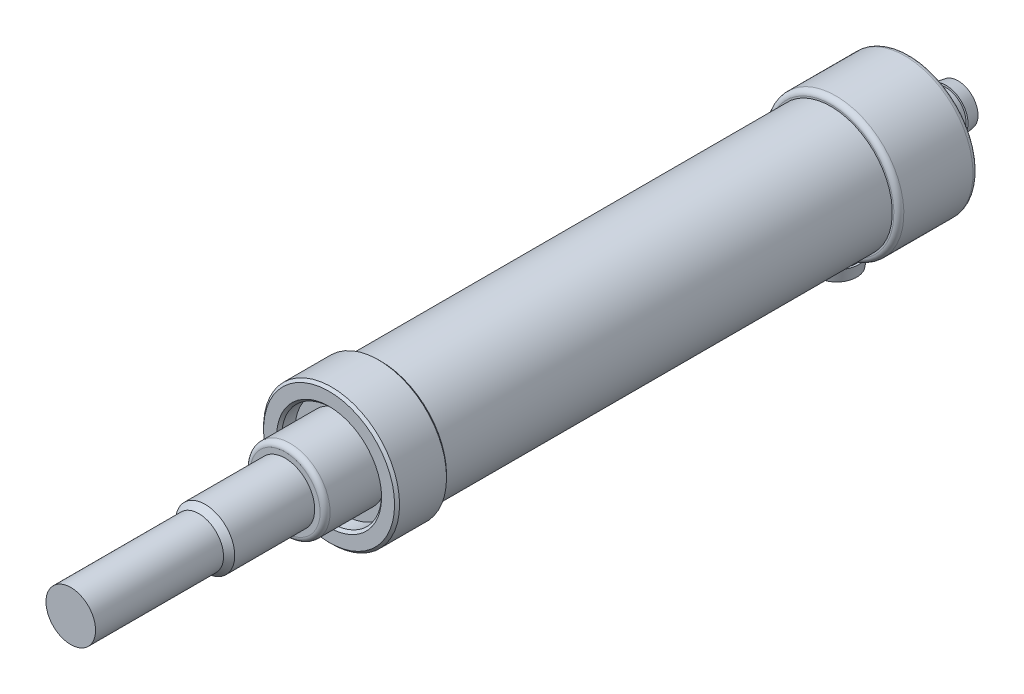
ISO-10303-21;
HEADER;
FILE_DESCRIPTION(('STEP AP214'),'2;1');
FILE_NAME('part.step','',(''),(''),'','','');
FILE_SCHEMA(('AUTOMOTIVE_DESIGN { 1 0 10303 214 1 1 1 1 }'));
ENDSEC;
DATA;
#1=APPLICATION_CONTEXT('core data for automotive mechanical design processes');
#2=APPLICATION_PROTOCOL_DEFINITION('international standard','automotive_design',2000,#1);
#3=PRODUCT_CONTEXT('',#1,'mechanical');
#4=PRODUCT('Part','Part','',(#3));
#5=PRODUCT_RELATED_PRODUCT_CATEGORY('part','',(#4));
#6=PRODUCT_DEFINITION_FORMATION('','',#4);
#7=PRODUCT_DEFINITION_CONTEXT('part definition',#1,'design');
#8=PRODUCT_DEFINITION('design','',#6,#7);
#9=PRODUCT_DEFINITION_SHAPE('','',#8);
#10=(LENGTH_UNIT() NAMED_UNIT(*) SI_UNIT(.MILLI.,.METRE.));
#11=(NAMED_UNIT(*) PLANE_ANGLE_UNIT() SI_UNIT($,.RADIAN.));
#12=(NAMED_UNIT(*) SI_UNIT($,.STERADIAN.) SOLID_ANGLE_UNIT());
#13=UNCERTAINTY_MEASURE_WITH_UNIT(LENGTH_MEASURE(1.E-05),#10,'distance_accuracy_value','');
#14=(GEOMETRIC_REPRESENTATION_CONTEXT(3) GLOBAL_UNCERTAINTY_ASSIGNED_CONTEXT((#13)) GLOBAL_UNIT_ASSIGNED_CONTEXT((#10,
#11,#12)) REPRESENTATION_CONTEXT('',''));
#15=CARTESIAN_POINT('',(0.,0.,0.));
#16=DIRECTION('',(0.,0.,1.));
#17=DIRECTION('',(1.,0.,0.));
#18=AXIS2_PLACEMENT_3D('',#15,#16,#17);
#19=CARTESIAN_POINT('',(0.,-21.59,-25.146));
#20=DIRECTION('',(0.,1.,0.));
#21=DIRECTION('',(0.,0.,1.));
#22=AXIS2_PLACEMENT_3D('',#19,#20,#21);
#23=PLANE('',#22);
#24=DIRECTION('',(0.,0.,1.));
#25=VECTOR('',#24,1.);
#26=CARTESIAN_POINT('',(-20.0025,-21.59,-25.146));
#27=LINE('',#26,#25);
#28=CARTESIAN_POINT('',(-20.0025,-21.59,-1.5875));
#29=VERTEX_POINT('',#28);
#30=CARTESIAN_POINT('',(-20.0025,-21.59,-23.5585));
#31=VERTEX_POINT('',#30);
#32=EDGE_CURVE('E137',#29,#31,#27,.F.);
#33=ORIENTED_EDGE('',*,*,#32,.T.);
#34=DIRECTION('',(-1.,0.,0.));
#35=VECTOR('',#34,1.);
#36=CARTESIAN_POINT('',(0.,-21.59,-23.5585));
#37=LINE('',#36,#35);
#38=CARTESIAN_POINT('',(0.,-21.59,-23.5585));
#39=VERTEX_POINT('',#38);
#40=EDGE_CURVE('E139',#31,#39,#37,.F.);
#41=ORIENTED_EDGE('',*,*,#40,.T.);
#42=DIRECTION('',(0.,0.,1.));
#43=VECTOR('',#42,1.);
#44=CARTESIAN_POINT('',(0.,-21.59,-25.146));
#45=LINE('',#44,#43);
#46=CARTESIAN_POINT('',(0.,-21.59,-1.5875));
#47=VERTEX_POINT('',#46);
#48=EDGE_CURVE('E261',#39,#47,#45,.T.);
#49=ORIENTED_EDGE('',*,*,#48,.T.);
#50=DIRECTION('',(-1.,0.,0.));
#51=VECTOR('',#50,1.);
#52=CARTESIAN_POINT('',(0.,-21.59,-1.5875));
#53=LINE('',#52,#51);
#54=EDGE_CURVE('E135',#47,#29,#53,.T.);
#55=ORIENTED_EDGE('',*,*,#54,.T.);
#56=EDGE_LOOP('',(#33,#41,#49,#55));
#57=FACE_BOUND('',#56,.T.);
#58=CARTESIAN_POINT('',(-11.557,-21.59,-13.3985));
#59=DIRECTION('',(0.,1.,0.));
#60=DIRECTION('',(0.,0.,1.));
#61=AXIS2_PLACEMENT_3D('',#58,#59,#60);
#62=CIRCLE('',#61,6.35);
#63=CARTESIAN_POINT('',(-11.557,-21.59,-7.0485));
#64=VERTEX_POINT('',#63);
#65=EDGE_CURVE('E42',#64,#64,#62,.F.);
#66=ORIENTED_EDGE('',*,*,#65,.F.);
#67=EDGE_LOOP('',(#66));
#68=FACE_BOUND('',#67,.T.);
#69=ADVANCED_FACE('F34',(#57,#68),#23,.F.);
#70=CARTESIAN_POINT('',(0.,0.,-25.146));
#71=DIRECTION('',(0.,0.,-1.));
#72=DIRECTION('',(-1.,0.,0.));
#73=AXIS2_PLACEMENT_3D('',#70,#71,#72);
#74=PLANE('',#73);
#75=DIRECTION('',(0.,1.,0.));
#76=VECTOR('',#75,1.);
#77=CARTESIAN_POINT('',(-20.0025,0.,-25.146));
#78=LINE('',#77,#76);
#79=CARTESIAN_POINT('',(-20.0025,-20.0025,-25.146));
#80=VERTEX_POINT('',#79);
#81=CARTESIAN_POINT('',(-20.0025,0.,-25.146));
#82=VERTEX_POINT('',#81);
#83=EDGE_CURVE('E116',#80,#82,#78,.T.);
#84=ORIENTED_EDGE('',*,*,#83,.T.);
#85=CARTESIAN_POINT('',(0.,0.,-25.146));
#86=DIRECTION('',(0.,0.,-1.));
#87=DIRECTION('',(-1.,0.,0.));
#88=AXIS2_PLACEMENT_3D('',#85,#86,#87);
#89=CIRCLE('',#88,20.0025);
#90=CARTESIAN_POINT('',(0.,-20.0025,-25.146));
#91=VERTEX_POINT('',#90);
#92=EDGE_CURVE('E101',#82,#91,#89,.T.);
#93=ORIENTED_EDGE('',*,*,#92,.T.);
#94=DIRECTION('',(-1.,0.,0.));
#95=VECTOR('',#94,1.);
#96=CARTESIAN_POINT('',(-21.59,-20.0025,-25.146));
#97=LINE('',#96,#95);
#98=EDGE_CURVE('E110',#91,#80,#97,.T.);
#99=ORIENTED_EDGE('',*,*,#98,.T.);
#100=EDGE_LOOP('',(#84,#93,#99));
#101=FACE_BOUND('',#100,.T.);
#102=CARTESIAN_POINT('',(0.,0.,-25.146));
#103=DIRECTION('',(0.,0.,-1.));
#104=DIRECTION('',(-1.,0.,0.));
#105=AXIS2_PLACEMENT_3D('',#102,#103,#104);
#106=CIRCLE('',#105,6.35);
#107=CARTESIAN_POINT('',(6.35,0.,-25.146));
#108=VERTEX_POINT('',#107);
#109=EDGE_CURVE('E289',#108,#108,#106,.T.);
#110=ORIENTED_EDGE('',*,*,#109,.F.);
#111=EDGE_LOOP('',(#110));
#112=FACE_BOUND('',#111,.T.);
#113=ADVANCED_FACE('F119',(#101,#112),#74,.T.);
#114=CARTESIAN_POINT('',(0.,0.,154.305));
#115=DIRECTION('',(0.,0.,1.));
#116=DIRECTION('',(1.,0.,0.));
#117=AXIS2_PLACEMENT_3D('',#114,#115,#116);
#118=PLANE('',#117);
#119=CARTESIAN_POINT('',(0.,0.,154.305));
#120=DIRECTION('',(0.,0.,1.));
#121=DIRECTION('',(1.,0.,0.));
#122=AXIS2_PLACEMENT_3D('',#119,#120,#121);
#123=CIRCLE('',#122,15.875);
#124=CARTESIAN_POINT('',(15.875,0.,154.305));
#125=VERTEX_POINT('',#124);
#126=EDGE_CURVE('E238',#125,#125,#123,.T.);
#127=ORIENTED_EDGE('',*,*,#126,.T.);
#128=EDGE_LOOP('',(#127));
#129=FACE_BOUND('',#128,.T.);
#130=CARTESIAN_POINT('',(0.,0.,154.305));
#131=DIRECTION('',(0.,0.,1.));
#132=DIRECTION('',(1.,0.,0.));
#133=AXIS2_PLACEMENT_3D('',#130,#131,#132);
#134=CIRCLE('',#133,12.7);
#135=CARTESIAN_POINT('',(-12.7,0.,154.305));
#136=VERTEX_POINT('',#135);
#137=EDGE_CURVE('E240',#136,#136,#134,.T.);
#138=ORIENTED_EDGE('',*,*,#137,.F.);
#139=EDGE_LOOP('',(#138));
#140=FACE_BOUND('',#139,.T.);
#141=ADVANCED_FACE('F156',(#129,#140),#118,.T.);
#142=CARTESIAN_POINT('',(0.,0.,142.875));
#143=DIRECTION('',(0.,0.,-1.));
#144=DIRECTION('',(-1.,0.,0.));
#145=AXIS2_PLACEMENT_3D('',#142,#143,#144);
#146=CYLINDRICAL_SURFACE('',#145,19.4945);
#147=CARTESIAN_POINT('',(0.,0.,142.875));
#148=DIRECTION('',(0.,0.,1.));
#149=DIRECTION('',(1.,0.,0.));
#150=AXIS2_PLACEMENT_3D('',#147,#148,#149);
#151=CIRCLE('',#150,19.4945);
#152=CARTESIAN_POINT('',(19.4945,0.,142.875));
#153=VERTEX_POINT('',#152);
#154=EDGE_CURVE('E239',#153,#153,#151,.T.);
#155=ORIENTED_EDGE('',*,*,#154,.F.);
#156=EDGE_LOOP('',(#155));
#157=FACE_BOUND('',#156,.T.);
#158=CARTESIAN_POINT('',(0.,0.,0.));
#159=DIRECTION('',(0.,0.,-1.));
#160=DIRECTION('',(-1.,0.,0.));
#161=AXIS2_PLACEMENT_3D('',#158,#159,#160);
#162=CIRCLE('',#161,19.4945);
#163=CARTESIAN_POINT('',(-19.4945,0.,0.));
#164=VERTEX_POINT('',#163);
#165=EDGE_CURVE('E246',#164,#164,#162,.T.);
#166=ORIENTED_EDGE('',*,*,#165,.F.);
#167=EDGE_LOOP('',(#166));
#168=FACE_BOUND('',#167,.T.);
#169=ADVANCED_FACE('F36',(#157,#168),#146,.T.);
#170=CARTESIAN_POINT('',(0.,0.,142.875));
#171=DIRECTION('',(0.,0.,1.));
#172=DIRECTION('',(1.,0.,0.));
#173=AXIS2_PLACEMENT_3D('',#170,#171,#172);
#174=PLANE('',#173);
#175=CARTESIAN_POINT('',(0.,0.,142.875));
#176=DIRECTION('',(0.,0.,1.));
#177=DIRECTION('',(1.,0.,0.));
#178=AXIS2_PLACEMENT_3D('',#175,#176,#177);
#179=CIRCLE('',#178,20.79625);
#180=CARTESIAN_POINT('',(20.79625,0.,142.875));
#181=VERTEX_POINT('',#180);
#182=EDGE_CURVE('E218',#181,#181,#179,.F.);
#183=ORIENTED_EDGE('',*,*,#182,.T.);
#184=EDGE_LOOP('',(#183));
#185=FACE_BOUND('',#184,.T.);
#186=ORIENTED_EDGE('',*,*,#154,.T.);
#187=EDGE_LOOP('',(#186));
#188=FACE_BOUND('',#187,.T.);
#189=ADVANCED_FACE('F198',(#185,#188),#174,.F.);
#190=CARTESIAN_POINT('',(0.,0.,159.385));
#191=DIRECTION('',(0.,0.,-1.));
#192=DIRECTION('',(-1.,0.,0.));
#193=AXIS2_PLACEMENT_3D('',#190,#191,#192);
#194=CYLINDRICAL_SURFACE('',#193,21.59);
#195=CARTESIAN_POINT('',(0.,0.,143.66875));
#196=DIRECTION('',(0.,0.,1.));
#197=DIRECTION('',(1.,0.,0.));
#198=AXIS2_PLACEMENT_3D('',#195,#196,#197);
#199=CIRCLE('',#198,21.59);
#200=CARTESIAN_POINT('',(21.59,0.,143.66875));
#201=VERTEX_POINT('',#200);
#202=EDGE_CURVE('E212',#201,#201,#199,.T.);
#203=ORIENTED_EDGE('',*,*,#202,.T.);
#204=EDGE_LOOP('',(#203));
#205=FACE_BOUND('',#204,.T.);
#206=CARTESIAN_POINT('',(0.,0.,158.59125));
#207=DIRECTION('',(0.,0.,1.));
#208=DIRECTION('',(1.,0.,0.));
#209=AXIS2_PLACEMENT_3D('',#206,#207,#208);
#210=CIRCLE('',#209,21.59);
#211=CARTESIAN_POINT('',(21.59,0.,158.59125));
#212=VERTEX_POINT('',#211);
#213=EDGE_CURVE('E215',#212,#212,#210,.F.);
#214=ORIENTED_EDGE('',*,*,#213,.T.);
#215=EDGE_LOOP('',(#214));
#216=FACE_BOUND('',#215,.T.);
#217=ADVANCED_FACE('F201',(#205,#216),#194,.T.);
#218=CARTESIAN_POINT('',(0.,0.,159.385));
#219=DIRECTION('',(0.,0.,1.));
#220=DIRECTION('',(1.,0.,0.));
#221=AXIS2_PLACEMENT_3D('',#218,#219,#220);
#222=PLANE('',#221);
#223=CARTESIAN_POINT('',(0.,0.,159.385));
#224=DIRECTION('',(0.,0.,1.));
#225=DIRECTION('',(1.,0.,0.));
#226=AXIS2_PLACEMENT_3D('',#223,#224,#225);
#227=CIRCLE('',#226,16.66875);
#228=CARTESIAN_POINT('',(16.66875,0.,159.385));
#229=VERTEX_POINT('',#228);
#230=EDGE_CURVE('E117',#229,#229,#227,.F.);
#231=ORIENTED_EDGE('',*,*,#230,.T.);
#232=EDGE_LOOP('',(#231));
#233=FACE_BOUND('',#232,.T.);
#234=CARTESIAN_POINT('',(0.,0.,159.385));
#235=DIRECTION('',(0.,0.,1.));
#236=DIRECTION('',(1.,0.,0.));
#237=AXIS2_PLACEMENT_3D('',#234,#235,#236);
#238=CIRCLE('',#237,20.79625);
#239=CARTESIAN_POINT('',(20.79625,0.,159.385));
#240=VERTEX_POINT('',#239);
#241=EDGE_CURVE('E216',#240,#240,#238,.T.);
#242=ORIENTED_EDGE('',*,*,#241,.T.);
#243=EDGE_LOOP('',(#242));
#244=FACE_BOUND('',#243,.T.);
#245=ADVANCED_FACE('F196',(#233,#244),#222,.T.);
#246=CARTESIAN_POINT('',(0.,0.,154.305));
#247=DIRECTION('',(0.,0.,1.));
#248=DIRECTION('',(1.,0.,0.));
#249=AXIS2_PLACEMENT_3D('',#246,#247,#248);
#250=CYLINDRICAL_SURFACE('',#249,15.875);
#251=CARTESIAN_POINT('',(0.,0.,158.59125));
#252=DIRECTION('',(0.,0.,1.));
#253=DIRECTION('',(1.,0.,0.));
#254=AXIS2_PLACEMENT_3D('',#251,#252,#253);
#255=CIRCLE('',#254,15.875);
#256=CARTESIAN_POINT('',(15.875,0.,158.59125));
#257=VERTEX_POINT('',#256);
#258=EDGE_CURVE('E227',#257,#257,#255,.T.);
#259=ORIENTED_EDGE('',*,*,#258,.T.);
#260=EDGE_LOOP('',(#259));
#261=FACE_BOUND('',#260,.T.);
#262=ORIENTED_EDGE('',*,*,#126,.F.);
#263=EDGE_LOOP('',(#262));
#264=FACE_BOUND('',#263,.T.);
#265=ADVANCED_FACE('F189',(#261,#264),#250,.F.);
#266=CARTESIAN_POINT('',(0.,0.,173.355));
#267=DIRECTION('',(0.,0.,-1.));
#268=DIRECTION('',(-1.,0.,0.));
#269=AXIS2_PLACEMENT_3D('',#266,#267,#268);
#270=CYLINDRICAL_SURFACE('',#269,12.7);
#271=CARTESIAN_POINT('',(0.,0.,171.7675));
#272=DIRECTION('',(0.,0.,1.));
#273=DIRECTION('',(1.,0.,0.));
#274=AXIS2_PLACEMENT_3D('',#271,#272,#273);
#275=CIRCLE('',#274,12.7);
#276=CARTESIAN_POINT('',(-12.7,0.,171.7675));
#277=VERTEX_POINT('',#276);
#278=EDGE_CURVE('E221',#277,#277,#275,.F.);
#279=CARTESIAN_POINT('',(-12.7,0.,171.7675));
#280=CARTESIAN_POINT('',(-12.7,0.,171.585598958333));
#281=CARTESIAN_POINT('',(-12.7,0.,171.403697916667));
#282=CARTESIAN_POINT('',(-12.7,0.,171.039895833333));
#283=CARTESIAN_POINT('',(-12.7,0.,170.857994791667));
#284=CARTESIAN_POINT('',(-12.7,0.,170.494192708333));
#285=CARTESIAN_POINT('',(-12.7,0.,170.312291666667));
#286=CARTESIAN_POINT('',(-12.7,0.,169.948489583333));
#287=CARTESIAN_POINT('',(-12.7,0.,169.766588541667));
#288=CARTESIAN_POINT('',(-12.7,0.,169.402786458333));
#289=CARTESIAN_POINT('',(-12.7,0.,169.220885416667));
#290=CARTESIAN_POINT('',(-12.7,0.,168.857083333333));
#291=CARTESIAN_POINT('',(-12.7,0.,168.675182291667));
#292=CARTESIAN_POINT('',(-12.7,0.,168.311380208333));
#293=CARTESIAN_POINT('',(-12.7,0.,168.129479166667));
#294=CARTESIAN_POINT('',(-12.7,0.,167.765677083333));
#295=CARTESIAN_POINT('',(-12.7,0.,167.583776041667));
#296=CARTESIAN_POINT('',(-12.7,0.,167.219973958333));
#297=CARTESIAN_POINT('',(-12.7,0.,167.038072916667));
#298=CARTESIAN_POINT('',(-12.7,0.,166.674270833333));
#299=CARTESIAN_POINT('',(-12.7,0.,166.492369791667));
#300=CARTESIAN_POINT('',(-12.7,0.,166.128567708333));
#301=CARTESIAN_POINT('',(-12.7,0.,165.946666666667));
#302=CARTESIAN_POINT('',(-12.7,0.,165.582864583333));
#303=CARTESIAN_POINT('',(-12.7,0.,165.400963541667));
#304=CARTESIAN_POINT('',(-12.7,0.,165.037161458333));
#305=CARTESIAN_POINT('',(-12.7,0.,164.855260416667));
#306=CARTESIAN_POINT('',(-12.7,0.,164.491458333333));
#307=CARTESIAN_POINT('',(-12.7,0.,164.309557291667));
#308=CARTESIAN_POINT('',(-12.7,0.,163.945755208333));
#309=CARTESIAN_POINT('',(-12.7,0.,163.763854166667));
#310=CARTESIAN_POINT('',(-12.7,0.,163.400052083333));
#311=CARTESIAN_POINT('',(-12.7,0.,163.218151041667));
#312=CARTESIAN_POINT('',(-12.7,0.,162.854348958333));
#313=CARTESIAN_POINT('',(-12.7,0.,162.672447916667));
#314=CARTESIAN_POINT('',(-12.7,0.,162.308645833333));
#315=CARTESIAN_POINT('',(-12.7,0.,162.126744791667));
#316=CARTESIAN_POINT('',(-12.7,0.,161.762942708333));
#317=CARTESIAN_POINT('',(-12.7,0.,161.581041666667));
#318=CARTESIAN_POINT('',(-12.7,0.,161.217239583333));
#319=CARTESIAN_POINT('',(-12.7,0.,161.035338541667));
#320=CARTESIAN_POINT('',(-12.7,0.,160.671536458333));
#321=CARTESIAN_POINT('',(-12.7,0.,160.489635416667));
#322=CARTESIAN_POINT('',(-12.7,0.,160.125833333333));
#323=CARTESIAN_POINT('',(-12.7,0.,159.943932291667));
#324=CARTESIAN_POINT('',(-12.7,0.,159.580130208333));
#325=CARTESIAN_POINT('',(-12.7,0.,159.398229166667));
#326=CARTESIAN_POINT('',(-12.7,0.,159.034427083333));
#327=CARTESIAN_POINT('',(-12.7,0.,158.852526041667));
#328=CARTESIAN_POINT('',(-12.7,0.,158.488723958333));
#329=CARTESIAN_POINT('',(-12.7,0.,158.306822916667));
#330=CARTESIAN_POINT('',(-12.7,0.,157.943020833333));
#331=CARTESIAN_POINT('',(-12.7,0.,157.761119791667));
#332=CARTESIAN_POINT('',(-12.7,0.,157.397317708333));
#333=CARTESIAN_POINT('',(-12.7,0.,157.215416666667));
#334=CARTESIAN_POINT('',(-12.7,0.,156.851614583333));
#335=CARTESIAN_POINT('',(-12.7,0.,156.669713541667));
#336=CARTESIAN_POINT('',(-12.7,0.,156.305911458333));
#337=CARTESIAN_POINT('',(-12.7,0.,156.124010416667));
#338=CARTESIAN_POINT('',(-12.7,0.,155.760208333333));
#339=CARTESIAN_POINT('',(-12.7,0.,155.578307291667));
#340=CARTESIAN_POINT('',(-12.7,0.,155.214505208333));
#341=CARTESIAN_POINT('',(-12.7,0.,155.032604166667));
#342=CARTESIAN_POINT('',(-12.7,0.,154.668802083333));
#343=CARTESIAN_POINT('',(-12.7,0.,154.486901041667));
#344=CARTESIAN_POINT('',(-12.7,0.,154.305));
#345=B_SPLINE_CURVE_WITH_KNOTS('',3,(#279,#280,#281,#282,#283,#284,#285,#286,#287,#288,#289,
#290,#291,#292,#293,#294,#295,#296,#297,#298,#299,#300,#301,#302,#303,#304,#305,#306,#307,#308,
#309,#310,#311,#312,#313,#314,#315,#316,#317,#318,#319,#320,#321,#322,#323,#324,#325,#326,#327,
#328,#329,#330,#331,#332,#333,#334,#335,#336,#337,#338,#339,#340,#341,#342,#343,#344),
.UNSPECIFIED.,.F.,.F.,(4,2,2,2,2,2,2,2,2,2,2,2,2,2,2,2,2,2,2,2,2,2,2,2,2,2,2,2,2,2,2,2,4),(0.,
0.545703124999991,1.09140624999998,1.637109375,2.18281249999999,2.72851562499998,3.27421875,
3.81992187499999,4.36562499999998,4.911328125,5.45703124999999,6.00273437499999,6.5484375,
7.094140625,7.63984374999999,8.18554687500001,8.73125,9.27695312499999,9.82265625,10.368359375,
10.9140625,11.459765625,12.00546875,12.551171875,13.096875,13.642578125,14.18828125,
14.733984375,15.2796875,15.825390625,16.37109375,16.916796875,17.4625),.UNSPECIFIED.);
#346=EDGE_CURVE('BSEAM185',#277,#136,#345,.T.);
#347=ORIENTED_EDGE('',*,*,#278,.T.);
#348=ORIENTED_EDGE('',*,*,#137,.T.);
#349=ORIENTED_EDGE('',*,*,#346,.T.);
#350=ORIENTED_EDGE('',*,*,#346,.F.);
#351=EDGE_LOOP('',(#347,#349,#348,#350));
#352=FACE_BOUND('',#351,.T.);
#353=ADVANCED_FACE('F185',(#352),#270,.T.);
#354=CARTESIAN_POINT('',(0.,0.,173.355));
#355=DIRECTION('',(0.,0.,1.));
#356=DIRECTION('',(1.,0.,0.));
#357=AXIS2_PLACEMENT_3D('',#354,#355,#356);
#358=PLANE('',#357);
#359=CARTESIAN_POINT('',(0.,0.,173.355));
#360=DIRECTION('',(0.,0.,1.));
#361=DIRECTION('',(1.,0.,0.));
#362=AXIS2_PLACEMENT_3D('',#359,#360,#361);
#363=CIRCLE('',#362,9.39799999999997);
#364=CARTESIAN_POINT('',(9.39799999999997,0.,173.355));
#365=VERTEX_POINT('',#364);
#366=EDGE_CURVE('E11',#365,#365,#363,.T.);
#367=ORIENTED_EDGE('',*,*,#366,.F.);
#368=EDGE_LOOP('',(#367));
#369=FACE_BOUND('',#368,.T.);
#370=CARTESIAN_POINT('',(0.,0.,173.355));
#371=DIRECTION('',(0.,0.,1.));
#372=DIRECTION('',(1.,0.,0.));
#373=AXIS2_PLACEMENT_3D('',#370,#371,#372);
#374=CIRCLE('',#373,11.1125);
#375=CARTESIAN_POINT('',(11.1125,0.,173.355));
#376=VERTEX_POINT('',#375);
#377=EDGE_CURVE('E243',#376,#376,#374,.T.);
#378=ORIENTED_EDGE('',*,*,#377,.T.);
#379=EDGE_LOOP('',(#378));
#380=FACE_BOUND('',#379,.T.);
#381=ADVANCED_FACE('F181',(#369,#380),#358,.T.);
#382=CARTESIAN_POINT('',(0.,0.,171.7675));
#383=DIRECTION('',(0.,0.,1.));
#384=DIRECTION('',(1.,0.,0.));
#385=AXIS2_PLACEMENT_3D('',#382,#383,#384);
#386=TOROIDAL_SURFACE('',#385,11.1125,1.5875);
#387=ORIENTED_EDGE('',*,*,#278,.F.);
#388=EDGE_LOOP('',(#387));
#389=FACE_BOUND('',#388,.T.);
#390=ORIENTED_EDGE('',*,*,#377,.F.);
#391=EDGE_LOOP('',(#390));
#392=FACE_BOUND('',#391,.T.);
#393=ADVANCED_FACE('F177',(#389,#392),#386,.T.);
#394=CARTESIAN_POINT('',(0.,0.,159.385));
#395=DIRECTION('',(0.,0.,-1.));
#396=DIRECTION('',(-1.,0.,0.));
#397=AXIS2_PLACEMENT_3D('',#394,#395,#396);
#398=CONICAL_SURFACE('',#397,20.79625,0.785398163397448);
#399=ORIENTED_EDGE('',*,*,#213,.F.);
#400=EDGE_LOOP('',(#399));
#401=FACE_BOUND('',#400,.T.);
#402=ORIENTED_EDGE('',*,*,#241,.F.);
#403=EDGE_LOOP('',(#402));
#404=FACE_BOUND('',#403,.T.);
#405=ADVANCED_FACE('F173',(#401,#404),#398,.T.);
#406=CARTESIAN_POINT('',(0.,0.,143.66875));
#407=DIRECTION('',(0.,0.,1.));
#408=DIRECTION('',(1.,0.,0.));
#409=AXIS2_PLACEMENT_3D('',#406,#407,#408);
#410=CONICAL_SURFACE('',#409,21.59,0.785398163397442);
#411=ORIENTED_EDGE('',*,*,#182,.F.);
#412=EDGE_LOOP('',(#411));
#413=FACE_BOUND('',#412,.T.);
#414=ORIENTED_EDGE('',*,*,#202,.F.);
#415=EDGE_LOOP('',(#414));
#416=FACE_BOUND('',#415,.T.);
#417=ADVANCED_FACE('F169',(#413,#416),#410,.T.);
#418=CARTESIAN_POINT('',(0.,0.,158.59125));
#419=DIRECTION('',(0.,0.,1.));
#420=DIRECTION('',(1.,0.,0.));
#421=AXIS2_PLACEMENT_3D('',#418,#419,#420);
#422=CONICAL_SURFACE('',#421,15.875,0.785398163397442);
#423=ORIENTED_EDGE('',*,*,#230,.F.);
#424=EDGE_LOOP('',(#423));
#425=FACE_BOUND('',#424,.T.);
#426=ORIENTED_EDGE('',*,*,#258,.F.);
#427=EDGE_LOOP('',(#426));
#428=FACE_BOUND('',#427,.T.);
#429=ADVANCED_FACE('F166',(#425,#428),#422,.F.);
#430=CARTESIAN_POINT('',(0.,0.,0.));
#431=DIRECTION('',(0.,0.,-1.));
#432=DIRECTION('',(-1.,0.,0.));
#433=AXIS2_PLACEMENT_3D('',#430,#431,#432);
#434=PLANE('',#433);
#435=CARTESIAN_POINT('',(0.,0.,0.));
#436=DIRECTION('',(0.,0.,-1.));
#437=DIRECTION('',(-1.,0.,0.));
#438=AXIS2_PLACEMENT_3D('',#435,#436,#437);
#439=CIRCLE('',#438,20.0025);
#440=CARTESIAN_POINT('',(0.,-20.0025,0.));
#441=VERTEX_POINT('',#440);
#442=CARTESIAN_POINT('',(-20.0025,0.,0.));
#443=VERTEX_POINT('',#442);
#444=EDGE_CURVE('E57',#441,#443,#439,.F.);
#445=ORIENTED_EDGE('',*,*,#444,.T.);
#446=DIRECTION('',(0.,1.,0.));
#447=VECTOR('',#446,1.);
#448=CARTESIAN_POINT('',(-20.0025,0.,0.));
#449=LINE('',#448,#447);
#450=CARTESIAN_POINT('',(-20.0025,-20.0025,0.));
#451=VERTEX_POINT('',#450);
#452=EDGE_CURVE('E144',#443,#451,#449,.F.);
#453=ORIENTED_EDGE('',*,*,#452,.T.);
#454=DIRECTION('',(-1.,0.,0.));
#455=VECTOR('',#454,1.);
#456=CARTESIAN_POINT('',(0.,-20.0025,0.));
#457=LINE('',#456,#455);
#458=EDGE_CURVE('E142',#451,#441,#457,.F.);
#459=ORIENTED_EDGE('',*,*,#458,.T.);
#460=EDGE_LOOP('',(#445,#453,#459));
#461=FACE_BOUND('',#460,.T.);
#462=ORIENTED_EDGE('',*,*,#165,.T.);
#463=EDGE_LOOP('',(#462));
#464=FACE_BOUND('',#463,.T.);
#465=ADVANCED_FACE('F164',(#461,#464),#434,.F.);
#466=CARTESIAN_POINT('',(0.,0.,-25.146));
#467=DIRECTION('',(0.,0.,1.));
#468=DIRECTION('',(1.,0.,0.));
#469=AXIS2_PLACEMENT_3D('',#466,#467,#468);
#470=CYLINDRICAL_SURFACE('',#469,21.59);
#471=ORIENTED_EDGE('',*,*,#48,.F.);
#472=CARTESIAN_POINT('',(0.,0.,-23.5585));
#473=DIRECTION('',(0.,0.,-1.));
#474=DIRECTION('',(-1.,0.,0.));
#475=AXIS2_PLACEMENT_3D('',#472,#473,#474);
#476=CIRCLE('',#475,21.59);
#477=CARTESIAN_POINT('',(-21.59,0.,-23.5585));
#478=VERTEX_POINT('',#477);
#479=EDGE_CURVE('E103',#39,#478,#476,.F.);
#480=ORIENTED_EDGE('',*,*,#479,.T.);
#481=DIRECTION('',(0.,0.,1.));
#482=VECTOR('',#481,1.);
#483=CARTESIAN_POINT('',(-21.59,0.,-25.146));
#484=LINE('',#483,#482);
#485=CARTESIAN_POINT('',(-21.59,0.,-1.5875));
#486=VERTEX_POINT('',#485);
#487=EDGE_CURVE('E264',#478,#486,#484,.T.);
#488=ORIENTED_EDGE('',*,*,#487,.T.);
#489=CARTESIAN_POINT('',(0.,0.,-1.5875));
#490=DIRECTION('',(0.,0.,-1.));
#491=DIRECTION('',(-1.,0.,0.));
#492=AXIS2_PLACEMENT_3D('',#489,#490,#491);
#493=CIRCLE('',#492,21.59);
#494=EDGE_CURVE('E123',#486,#47,#493,.T.);
#495=ORIENTED_EDGE('',*,*,#494,.T.);
#496=EDGE_LOOP('',(#471,#480,#488,#495));
#497=FACE_BOUND('',#496,.T.);
#498=ADVANCED_FACE('F161',(#497),#470,.T.);
#499=CARTESIAN_POINT('',(-21.59,0.,-25.146));
#500=DIRECTION('',(1.,0.,0.));
#501=DIRECTION('',(0.,0.,-1.));
#502=AXIS2_PLACEMENT_3D('',#499,#500,#501);
#503=PLANE('',#502);
#504=ORIENTED_EDGE('',*,*,#487,.F.);
#505=DIRECTION('',(0.,1.,0.));
#506=VECTOR('',#505,1.);
#507=CARTESIAN_POINT('',(-21.59,-21.59,-23.5585));
#508=LINE('',#507,#506);
#509=CARTESIAN_POINT('',(-21.59,-20.0025,-23.5585));
#510=VERTEX_POINT('',#509);
#511=EDGE_CURVE('E133',#478,#510,#508,.F.);
#512=ORIENTED_EDGE('',*,*,#511,.T.);
#513=DIRECTION('',(0.,0.,1.));
#514=VECTOR('',#513,1.);
#515=CARTESIAN_POINT('',(-21.59,-20.0025,-25.146));
#516=LINE('',#515,#514);
#517=CARTESIAN_POINT('',(-21.59,-20.0025,-1.5875));
#518=VERTEX_POINT('',#517);
#519=EDGE_CURVE('E131',#510,#518,#516,.T.);
#520=ORIENTED_EDGE('',*,*,#519,.T.);
#521=DIRECTION('',(0.,1.,0.));
#522=VECTOR('',#521,1.);
#523=CARTESIAN_POINT('',(-21.59,0.,-1.5875));
#524=LINE('',#523,#522);
#525=EDGE_CURVE('E129',#518,#486,#524,.T.);
#526=ORIENTED_EDGE('',*,*,#525,.T.);
#527=EDGE_LOOP('',(#504,#512,#520,#526));
#528=FACE_BOUND('',#527,.T.);
#529=ADVANCED_FACE('F160',(#528),#503,.F.);
#530=CARTESIAN_POINT('',(0.,0.,-1.5875));
#531=DIRECTION('',(0.,0.,-1.));
#532=DIRECTION('',(-1.,0.,0.));
#533=AXIS2_PLACEMENT_3D('',#530,#531,#532);
#534=TOROIDAL_SURFACE('',#533,20.0025,1.5875);
#535=CARTESIAN_POINT('',(0.,-20.0025,-1.5875));
#536=DIRECTION('',(-1.,0.,0.));
#537=DIRECTION('',(0.,0.,1.));
#538=AXIS2_PLACEMENT_3D('',#535,#536,#537);
#539=CIRCLE('',#538,1.5875);
#540=EDGE_CURVE('E270',#47,#441,#539,.T.);
#541=ORIENTED_EDGE('',*,*,#540,.F.);
#542=ORIENTED_EDGE('',*,*,#494,.F.);
#543=CARTESIAN_POINT('',(-20.0025,0.,-1.5875));
#544=DIRECTION('',(0.,-1.,0.));
#545=DIRECTION('',(0.,0.,-1.));
#546=AXIS2_PLACEMENT_3D('',#543,#544,#545);
#547=CIRCLE('',#546,1.5875);
#548=EDGE_CURVE('E267',#443,#486,#547,.T.);
#549=ORIENTED_EDGE('',*,*,#548,.F.);
#550=ORIENTED_EDGE('',*,*,#444,.F.);
#551=EDGE_LOOP('',(#541,#542,#549,#550));
#552=FACE_BOUND('',#551,.T.);
#553=ADVANCED_FACE('F478',(#552),#534,.T.);
#554=CARTESIAN_POINT('',(-20.0025,0.,-1.5875));
#555=DIRECTION('',(0.,1.,0.));
#556=DIRECTION('',(0.,0.,1.));
#557=AXIS2_PLACEMENT_3D('',#554,#555,#556);
#558=CYLINDRICAL_SURFACE('',#557,1.5875);
#559=ORIENTED_EDGE('',*,*,#548,.T.);
#560=ORIENTED_EDGE('',*,*,#525,.F.);
#561=CARTESIAN_POINT('',(-20.0025,-20.0025,-1.5875));
#562=DIRECTION('',(0.,-1.,0.));
#563=DIRECTION('',(0.,0.,-1.));
#564=AXIS2_PLACEMENT_3D('',#561,#562,#563);
#565=CIRCLE('',#564,1.5875);
#566=EDGE_CURVE('E273',#451,#518,#565,.T.);
#567=ORIENTED_EDGE('',*,*,#566,.F.);
#568=ORIENTED_EDGE('',*,*,#452,.F.);
#569=EDGE_LOOP('',(#559,#560,#567,#568));
#570=FACE_BOUND('',#569,.T.);
#571=ADVANCED_FACE('F474',(#570),#558,.T.);
#572=CARTESIAN_POINT('',(0.,-20.0025,-1.5875));
#573=DIRECTION('',(-1.,0.,0.));
#574=DIRECTION('',(0.,0.,1.));
#575=AXIS2_PLACEMENT_3D('',#572,#573,#574);
#576=CYLINDRICAL_SURFACE('',#575,1.5875);
#577=ORIENTED_EDGE('',*,*,#540,.T.);
#578=ORIENTED_EDGE('',*,*,#458,.F.);
#579=CARTESIAN_POINT('',(-20.0025,-20.0025,-1.5875));
#580=DIRECTION('',(-1.,0.,0.));
#581=DIRECTION('',(0.,0.,1.));
#582=AXIS2_PLACEMENT_3D('',#579,#580,#581);
#583=CIRCLE('',#582,1.5875);
#584=EDGE_CURVE('E49',#29,#451,#583,.T.);
#585=ORIENTED_EDGE('',*,*,#584,.F.);
#586=ORIENTED_EDGE('',*,*,#54,.F.);
#587=EDGE_LOOP('',(#577,#578,#585,#586));
#588=FACE_BOUND('',#587,.T.);
#589=ADVANCED_FACE('F471',(#588),#576,.T.);
#590=CARTESIAN_POINT('',(-20.0025,-20.0025,-1.5875));
#591=DIRECTION('',(0.,0.,1.));
#592=DIRECTION('',(1.,0.,0.));
#593=AXIS2_PLACEMENT_3D('',#590,#591,#592);
#594=SPHERICAL_SURFACE('',#593,1.5875);
#595=ORIENTED_EDGE('',*,*,#584,.T.);
#596=ORIENTED_EDGE('',*,*,#566,.T.);
#597=CARTESIAN_POINT('',(-20.0025,-20.0025,-1.5875));
#598=DIRECTION('',(0.,0.,1.));
#599=DIRECTION('',(1.,0.,0.));
#600=AXIS2_PLACEMENT_3D('',#597,#598,#599);
#601=CIRCLE('',#600,1.5875);
#602=EDGE_CURVE('E276',#29,#518,#601,.F.);
#603=ORIENTED_EDGE('',*,*,#602,.F.);
#604=EDGE_LOOP('',(#595,#596,#603));
#605=FACE_BOUND('',#604,.T.);
#606=ADVANCED_FACE('F467',(#605),#594,.T.);
#607=CARTESIAN_POINT('',(-20.0025,-20.0025,-25.146));
#608=DIRECTION('',(0.,0.,1.));
#609=DIRECTION('',(1.,0.,0.));
#610=AXIS2_PLACEMENT_3D('',#607,#608,#609);
#611=CYLINDRICAL_SURFACE('',#610,1.5875);
#612=CARTESIAN_POINT('',(-20.0025,-20.0025,-23.5585));
#613=DIRECTION('',(0.,0.,-1.));
#614=DIRECTION('',(-1.,0.,0.));
#615=AXIS2_PLACEMENT_3D('',#612,#613,#614);
#616=CIRCLE('',#615,1.5875);
#617=EDGE_CURVE('E279',#31,#510,#616,.T.);
#618=ORIENTED_EDGE('',*,*,#617,.F.);
#619=ORIENTED_EDGE('',*,*,#32,.F.);
#620=ORIENTED_EDGE('',*,*,#602,.T.);
#621=ORIENTED_EDGE('',*,*,#519,.F.);
#622=EDGE_LOOP('',(#618,#619,#620,#621));
#623=FACE_BOUND('',#622,.T.);
#624=ADVANCED_FACE('F463',(#623),#611,.T.);
#625=CARTESIAN_POINT('',(-20.0025,-20.0025,-23.5585));
#626=DIRECTION('',(0.,0.,1.));
#627=DIRECTION('',(1.,0.,0.));
#628=AXIS2_PLACEMENT_3D('',#625,#626,#627);
#629=SPHERICAL_SURFACE('',#628,1.5875);
#630=CARTESIAN_POINT('',(-20.0025,-20.0025,-23.5585));
#631=DIRECTION('',(-1.,0.,0.));
#632=DIRECTION('',(0.,0.,1.));
#633=AXIS2_PLACEMENT_3D('',#630,#631,#632);
#634=CIRCLE('',#633,1.5875);
#635=EDGE_CURVE('E113',#31,#80,#634,.F.);
#636=ORIENTED_EDGE('',*,*,#635,.F.);
#637=ORIENTED_EDGE('',*,*,#617,.T.);
#638=CARTESIAN_POINT('',(-20.0025,-20.0025,-23.5585));
#639=DIRECTION('',(0.,-1.,0.));
#640=DIRECTION('',(0.,0.,-1.));
#641=AXIS2_PLACEMENT_3D('',#638,#639,#640);
#642=CIRCLE('',#641,1.5875);
#643=EDGE_CURVE('E282',#80,#510,#642,.F.);
#644=ORIENTED_EDGE('',*,*,#643,.F.);
#645=EDGE_LOOP('',(#636,#637,#644));
#646=FACE_BOUND('',#645,.T.);
#647=ADVANCED_FACE('F459',(#646),#629,.T.);
#648=CARTESIAN_POINT('',(-20.0025,0.,-23.5585));
#649=DIRECTION('',(0.,-1.,0.));
#650=DIRECTION('',(0.,0.,-1.));
#651=AXIS2_PLACEMENT_3D('',#648,#649,#650);
#652=CYLINDRICAL_SURFACE('',#651,1.5875);
#653=ORIENTED_EDGE('',*,*,#643,.T.);
#654=ORIENTED_EDGE('',*,*,#511,.F.);
#655=CARTESIAN_POINT('',(-20.0025,0.,-23.5585));
#656=DIRECTION('',(0.,1.,0.));
#657=DIRECTION('',(0.,0.,1.));
#658=AXIS2_PLACEMENT_3D('',#655,#656,#657);
#659=CIRCLE('',#658,1.5875);
#660=EDGE_CURVE('E106',#82,#478,#659,.T.);
#661=ORIENTED_EDGE('',*,*,#660,.F.);
#662=ORIENTED_EDGE('',*,*,#83,.F.);
#663=EDGE_LOOP('',(#653,#654,#661,#662));
#664=FACE_BOUND('',#663,.T.);
#665=ADVANCED_FACE('F456',(#664),#652,.T.);
#666=CARTESIAN_POINT('',(0.,-20.0025,-23.5585));
#667=DIRECTION('',(1.,0.,0.));
#668=DIRECTION('',(0.,0.,-1.));
#669=AXIS2_PLACEMENT_3D('',#666,#667,#668);
#670=CYLINDRICAL_SURFACE('',#669,1.5875);
#671=ORIENTED_EDGE('',*,*,#635,.T.);
#672=ORIENTED_EDGE('',*,*,#98,.F.);
#673=CARTESIAN_POINT('',(0.,-20.0025,-23.5585));
#674=DIRECTION('',(1.,0.,0.));
#675=DIRECTION('',(0.,0.,-1.));
#676=AXIS2_PLACEMENT_3D('',#673,#674,#675);
#677=CIRCLE('',#676,1.5875);
#678=EDGE_CURVE('E97',#39,#91,#677,.T.);
#679=ORIENTED_EDGE('',*,*,#678,.F.);
#680=ORIENTED_EDGE('',*,*,#40,.F.);
#681=EDGE_LOOP('',(#671,#672,#679,#680));
#682=FACE_BOUND('',#681,.T.);
#683=ADVANCED_FACE('F111',(#682),#670,.T.);
#684=CARTESIAN_POINT('',(0.,0.,-23.5585));
#685=DIRECTION('',(0.,0.,-1.));
#686=DIRECTION('',(-1.,0.,0.));
#687=AXIS2_PLACEMENT_3D('',#684,#685,#686);
#688=TOROIDAL_SURFACE('',#687,20.0025,1.5875);
#689=ORIENTED_EDGE('',*,*,#660,.T.);
#690=ORIENTED_EDGE('',*,*,#479,.F.);
#691=ORIENTED_EDGE('',*,*,#678,.T.);
#692=ORIENTED_EDGE('',*,*,#92,.F.);
#693=EDGE_LOOP('',(#689,#690,#691,#692));
#694=FACE_BOUND('',#693,.T.);
#695=ADVANCED_FACE('F99',(#694),#688,.T.);
#696=CARTESIAN_POINT('',(0.,0.,-28.956));
#697=DIRECTION('',(0.,0.,1.));
#698=DIRECTION('',(1.,0.,0.));
#699=AXIS2_PLACEMENT_3D('',#696,#697,#698);
#700=CYLINDRICAL_SURFACE('',#699,6.35);
#701=CARTESIAN_POINT('',(0.,0.,-28.956));
#702=DIRECTION('',(0.,0.,-1.));
#703=DIRECTION('',(-1.,0.,0.));
#704=AXIS2_PLACEMENT_3D('',#701,#702,#703);
#705=CIRCLE('',#704,6.35);
#706=CARTESIAN_POINT('',(6.35,0.,-28.956));
#707=VERTEX_POINT('',#706);
#708=EDGE_CURVE('E107',#707,#707,#705,.T.);
#709=CARTESIAN_POINT('',(6.35,0.,-28.956));
#710=CARTESIAN_POINT('',(6.35,0.,-28.9163125));
#711=CARTESIAN_POINT('',(6.35,0.,-28.876625));
#712=CARTESIAN_POINT('',(6.35,0.,-28.79725));
#713=CARTESIAN_POINT('',(6.35,0.,-28.7575625));
#714=CARTESIAN_POINT('',(6.35,0.,-28.6781875));
#715=CARTESIAN_POINT('',(6.35,0.,-28.6385));
#716=CARTESIAN_POINT('',(6.35,0.,-28.559125));
#717=CARTESIAN_POINT('',(6.35,0.,-28.5194375));
#718=CARTESIAN_POINT('',(6.35,0.,-28.4400625));
#719=CARTESIAN_POINT('',(6.35,0.,-28.400375));
#720=CARTESIAN_POINT('',(6.35,0.,-28.321));
#721=CARTESIAN_POINT('',(6.35,0.,-28.2813125));
#722=CARTESIAN_POINT('',(6.35,0.,-28.2019375));
#723=CARTESIAN_POINT('',(6.35,0.,-28.16225));
#724=CARTESIAN_POINT('',(6.35,0.,-28.082875));
#725=CARTESIAN_POINT('',(6.35,0.,-28.0431875));
#726=CARTESIAN_POINT('',(6.35,0.,-27.9638125));
#727=CARTESIAN_POINT('',(6.35,0.,-27.924125));
#728=CARTESIAN_POINT('',(6.35,0.,-27.84475));
#729=CARTESIAN_POINT('',(6.35,0.,-27.8050625));
#730=CARTESIAN_POINT('',(6.35,0.,-27.7256875));
#731=CARTESIAN_POINT('',(6.35,0.,-27.686));
#732=CARTESIAN_POINT('',(6.35,0.,-27.606625));
#733=CARTESIAN_POINT('',(6.35,0.,-27.5669375));
#734=CARTESIAN_POINT('',(6.35,0.,-27.4875625));
#735=CARTESIAN_POINT('',(6.35,0.,-27.447875));
#736=CARTESIAN_POINT('',(6.35,0.,-27.3685));
#737=CARTESIAN_POINT('',(6.35,0.,-27.3288125));
#738=CARTESIAN_POINT('',(6.35,0.,-27.2494375));
#739=CARTESIAN_POINT('',(6.35,0.,-27.20975));
#740=CARTESIAN_POINT('',(6.35,0.,-27.130375));
#741=CARTESIAN_POINT('',(6.35,0.,-27.0906875));
#742=CARTESIAN_POINT('',(6.35,0.,-27.0113125));
#743=CARTESIAN_POINT('',(6.35,0.,-26.971625));
#744=CARTESIAN_POINT('',(6.35,0.,-26.89225));
#745=CARTESIAN_POINT('',(6.35,0.,-26.8525625));
#746=CARTESIAN_POINT('',(6.35,0.,-26.7731875));
#747=CARTESIAN_POINT('',(6.35,0.,-26.7335));
#748=CARTESIAN_POINT('',(6.35,0.,-26.654125));
#749=CARTESIAN_POINT('',(6.35,0.,-26.6144375));
#750=CARTESIAN_POINT('',(6.35,0.,-26.5350625));
#751=CARTESIAN_POINT('',(6.35,0.,-26.495375));
#752=CARTESIAN_POINT('',(6.35,0.,-26.416));
#753=CARTESIAN_POINT('',(6.35,0.,-26.3763125));
#754=CARTESIAN_POINT('',(6.35,0.,-26.2969375));
#755=CARTESIAN_POINT('',(6.35,0.,-26.25725));
#756=CARTESIAN_POINT('',(6.35,0.,-26.177875));
#757=CARTESIAN_POINT('',(6.35,0.,-26.1381875));
#758=CARTESIAN_POINT('',(6.35,0.,-26.0588125));
#759=CARTESIAN_POINT('',(6.35,0.,-26.019125));
#760=CARTESIAN_POINT('',(6.35,0.,-25.93975));
#761=CARTESIAN_POINT('',(6.35,0.,-25.9000625));
#762=CARTESIAN_POINT('',(6.35,0.,-25.8206875));
#763=CARTESIAN_POINT('',(6.35,0.,-25.781));
#764=CARTESIAN_POINT('',(6.35,0.,-25.701625));
#765=CARTESIAN_POINT('',(6.35,0.,-25.6619375));
#766=CARTESIAN_POINT('',(6.35,0.,-25.5825625));
#767=CARTESIAN_POINT('',(6.35,0.,-25.542875));
#768=CARTESIAN_POINT('',(6.35,0.,-25.4635));
#769=CARTESIAN_POINT('',(6.35,0.,-25.4238125));
#770=CARTESIAN_POINT('',(6.35,0.,-25.3444375));
#771=CARTESIAN_POINT('',(6.35,0.,-25.30475));
#772=CARTESIAN_POINT('',(6.35,0.,-25.225375));
#773=CARTESIAN_POINT('',(6.35,0.,-25.1856875));
#774=CARTESIAN_POINT('',(6.35,0.,-25.146));
#775=B_SPLINE_CURVE_WITH_KNOTS('',3,(#709,#710,#711,#712,#713,#714,#715,#716,#717,#718,#719,
#720,#721,#722,#723,#724,#725,#726,#727,#728,#729,#730,#731,#732,#733,#734,#735,#736,#737,#738,
#739,#740,#741,#742,#743,#744,#745,#746,#747,#748,#749,#750,#751,#752,#753,#754,#755,#756,#757,
#758,#759,#760,#761,#762,#763,#764,#765,#766,#767,#768,#769,#770,#771,#772,#773,#774),
.UNSPECIFIED.,.F.,.F.,(4,2,2,2,2,2,2,2,2,2,2,2,2,2,2,2,2,2,2,2,2,2,2,2,2,2,2,2,2,2,2,2,4),(0.,
0.119062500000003,0.238125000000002,0.357187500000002,0.476250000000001,0.5953125,
0.714375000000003,0.833437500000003,0.952500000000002,1.0715625,1.190625,1.3096875,1.42875,
1.5478125,1.666875,1.7859375,1.905,2.0240625,2.143125,2.2621875,2.38125,2.5003125,2.619375,
2.7384375,2.8575,2.9765625,3.095625,3.2146875,3.33375,3.4528125,3.571875,3.6909375,3.81),.UNSPECIFIED.);
#776=EDGE_CURVE('BSEAM444',#707,#108,#775,.T.);
#777=ORIENTED_EDGE('',*,*,#708,.F.);
#778=ORIENTED_EDGE('',*,*,#109,.T.);
#779=ORIENTED_EDGE('',*,*,#776,.T.);
#780=ORIENTED_EDGE('',*,*,#776,.F.);
#781=EDGE_LOOP('',(#777,#779,#778,#780));
#782=FACE_BOUND('',#781,.T.);
#783=ADVANCED_FACE('F444',(#782),#700,.T.);
#784=CARTESIAN_POINT('',(0.,0.,-28.956));
#785=DIRECTION('',(0.,0.,-1.));
#786=DIRECTION('',(-1.,0.,0.));
#787=AXIS2_PLACEMENT_3D('',#784,#785,#786);
#788=PLANE('',#787);
#789=CARTESIAN_POINT('',(0.,0.,-28.956));
#790=DIRECTION('',(0.,0.,-1.));
#791=DIRECTION('',(-1.,0.,0.));
#792=AXIS2_PLACEMENT_3D('',#789,#790,#791);
#793=CIRCLE('',#792,6.985);
#794=CARTESIAN_POINT('',(-6.985,0.,-28.956));
#795=VERTEX_POINT('',#794);
#796=EDGE_CURVE('E295',#795,#795,#793,.T.);
#797=ORIENTED_EDGE('',*,*,#796,.F.);
#798=EDGE_LOOP('',(#797));
#799=FACE_BOUND('',#798,.T.);
#800=ORIENTED_EDGE('',*,*,#708,.T.);
#801=EDGE_LOOP('',(#800));
#802=FACE_BOUND('',#801,.T.);
#803=ADVANCED_FACE('F441',(#799,#802),#788,.F.);
#804=CARTESIAN_POINT('',(0.,0.,-28.956));
#805=DIRECTION('',(0.,0.,1.));
#806=DIRECTION('',(-1.,0.,0.));
#807=AXIS2_PLACEMENT_3D('',#804,#805,#806);
#808=CONICAL_SURFACE('',#807,6.985,0.165148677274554);
#809=CARTESIAN_POINT('',(0.,0.,-32.766));
#810=DIRECTION('',(0.,0.,-1.));
#811=DIRECTION('',(-1.,0.,0.));
#812=AXIS2_PLACEMENT_3D('',#809,#810,#811);
#813=CIRCLE('',#812,6.3500000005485);
#814=CARTESIAN_POINT('',(-6.3500000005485,0.,-32.766));
#815=VERTEX_POINT('',#814);
#816=EDGE_CURVE('E292',#815,#815,#813,.T.);
#817=ORIENTED_EDGE('',*,*,#816,.F.);
#818=EDGE_LOOP('',(#817));
#819=FACE_BOUND('',#818,.T.);
#820=ORIENTED_EDGE('',*,*,#796,.T.);
#821=EDGE_LOOP('',(#820));
#822=FACE_BOUND('',#821,.T.);
#823=ADVANCED_FACE('F436',(#819,#822),#808,.T.);
#824=CARTESIAN_POINT('',(0.,0.,-32.766));
#825=DIRECTION('',(0.,0.,-1.));
#826=DIRECTION('',(-1.,0.,0.));
#827=AXIS2_PLACEMENT_3D('',#824,#825,#826);
#828=PLANE('',#827);
#829=CARTESIAN_POINT('',(0.,0.,-32.766));
#830=DIRECTION('',(0.,0.,-1.));
#831=DIRECTION('',(-1.,0.,0.));
#832=AXIS2_PLACEMENT_3D('',#829,#830,#831);
#833=CIRCLE('',#832,6.985);
#834=CARTESIAN_POINT('',(-6.985,0.,-32.766));
#835=VERTEX_POINT('',#834);
#836=EDGE_CURVE('E301',#835,#835,#833,.T.);
#837=ORIENTED_EDGE('',*,*,#836,.F.);
#838=EDGE_LOOP('',(#837));
#839=FACE_BOUND('',#838,.T.);
#840=ORIENTED_EDGE('',*,*,#816,.T.);
#841=EDGE_LOOP('',(#840));
#842=FACE_BOUND('',#841,.T.);
#843=ADVANCED_FACE('F433',(#839,#842),#828,.F.);
#844=CARTESIAN_POINT('',(0.,0.,-32.766));
#845=DIRECTION('',(0.,0.,1.));
#846=DIRECTION('',(-1.,0.,0.));
#847=AXIS2_PLACEMENT_3D('',#844,#845,#846);
#848=CONICAL_SURFACE('',#847,6.985,0.165148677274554);
#849=CARTESIAN_POINT('',(0.,0.,-36.576));
#850=DIRECTION('',(0.,0.,-1.));
#851=DIRECTION('',(-1.,0.,0.));
#852=AXIS2_PLACEMENT_3D('',#849,#850,#851);
#853=CIRCLE('',#852,6.3500000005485);
#854=CARTESIAN_POINT('',(-6.3500000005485,0.,-36.576));
#855=VERTEX_POINT('',#854);
#856=EDGE_CURVE('E298',#855,#855,#853,.T.);
#857=ORIENTED_EDGE('',*,*,#856,.F.);
#858=EDGE_LOOP('',(#857));
#859=FACE_BOUND('',#858,.T.);
#860=ORIENTED_EDGE('',*,*,#836,.T.);
#861=EDGE_LOOP('',(#860));
#862=FACE_BOUND('',#861,.T.);
#863=ADVANCED_FACE('F425',(#859,#862),#848,.T.);
#864=CARTESIAN_POINT('',(0.,0.,-36.576));
#865=DIRECTION('',(0.,0.,-1.));
#866=DIRECTION('',(-1.,0.,0.));
#867=AXIS2_PLACEMENT_3D('',#864,#865,#866);
#868=PLANE('',#867);
#869=CARTESIAN_POINT('',(0.,0.,-36.576));
#870=DIRECTION('',(0.,0.,-1.));
#871=DIRECTION('',(-1.,0.,0.));
#872=AXIS2_PLACEMENT_3D('',#869,#870,#871);
#873=CIRCLE('',#872,6.985);
#874=CARTESIAN_POINT('',(-6.985,0.,-36.576));
#875=VERTEX_POINT('',#874);
#876=EDGE_CURVE('E307',#875,#875,#873,.T.);
#877=ORIENTED_EDGE('',*,*,#876,.F.);
#878=EDGE_LOOP('',(#877));
#879=FACE_BOUND('',#878,.T.);
#880=ORIENTED_EDGE('',*,*,#856,.T.);
#881=EDGE_LOOP('',(#880));
#882=FACE_BOUND('',#881,.T.);
#883=ADVANCED_FACE('F421',(#879,#882),#868,.F.);
#884=CARTESIAN_POINT('',(0.,0.,-36.576));
#885=DIRECTION('',(0.,0.,1.));
#886=DIRECTION('',(-1.,0.,0.));
#887=AXIS2_PLACEMENT_3D('',#884,#885,#886);
#888=CONICAL_SURFACE('',#887,6.985,0.165148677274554);
#889=CARTESIAN_POINT('',(0.,0.,-40.386));
#890=DIRECTION('',(0.,0.,-1.));
#891=DIRECTION('',(-1.,0.,0.));
#892=AXIS2_PLACEMENT_3D('',#889,#890,#891);
#893=CIRCLE('',#892,6.3500000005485);
#894=CARTESIAN_POINT('',(-6.3500000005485,0.,-40.386));
#895=VERTEX_POINT('',#894);
#896=EDGE_CURVE('E304',#895,#895,#893,.T.);
#897=ORIENTED_EDGE('',*,*,#896,.F.);
#898=EDGE_LOOP('',(#897));
#899=FACE_BOUND('',#898,.T.);
#900=ORIENTED_EDGE('',*,*,#876,.T.);
#901=EDGE_LOOP('',(#900));
#902=FACE_BOUND('',#901,.T.);
#903=ADVANCED_FACE('F424',(#899,#902),#888,.T.);
#904=CARTESIAN_POINT('',(0.,0.,-40.386));
#905=DIRECTION('',(0.,0.,-1.));
#906=DIRECTION('',(-1.,0.,0.));
#907=AXIS2_PLACEMENT_3D('',#904,#905,#906);
#908=PLANE('',#907);
#909=CARTESIAN_POINT('',(0.,0.,-40.386));
#910=DIRECTION('',(0.,0.,-1.));
#911=DIRECTION('',(-1.,0.,0.));
#912=AXIS2_PLACEMENT_3D('',#909,#910,#911);
#913=CIRCLE('',#912,5.0419);
#914=CARTESIAN_POINT('',(-5.0419,0.,-40.386));
#915=VERTEX_POINT('',#914);
#916=EDGE_CURVE('E340',#915,#915,#913,.T.);
#917=ORIENTED_EDGE('',*,*,#916,.F.);
#918=EDGE_LOOP('',(#917));
#919=FACE_BOUND('',#918,.T.);
#920=ORIENTED_EDGE('',*,*,#896,.T.);
#921=EDGE_LOOP('',(#920));
#922=FACE_BOUND('',#921,.T.);
#923=ADVANCED_FACE('F419',(#919,#922),#908,.T.);
#924=CARTESIAN_POINT('',(-11.557,-25.4,-13.3985));
#925=DIRECTION('',(0.,1.,0.));
#926=DIRECTION('',(0.,0.,1.));
#927=AXIS2_PLACEMENT_3D('',#924,#925,#926);
#928=CYLINDRICAL_SURFACE('',#927,6.35);
#929=CARTESIAN_POINT('',(-11.557,-25.4,-13.3985));
#930=DIRECTION('',(0.,-1.,0.));
#931=DIRECTION('',(0.,0.,-1.));
#932=AXIS2_PLACEMENT_3D('',#929,#930,#931);
#933=CIRCLE('',#932,6.35);
#934=CARTESIAN_POINT('',(-11.557,-25.4,-7.0485));
#935=VERTEX_POINT('',#934);
#936=EDGE_CURVE('E310',#935,#935,#933,.T.);
#937=CARTESIAN_POINT('',(-11.557,-25.4,-7.0485));
#938=CARTESIAN_POINT('',(-11.557,-25.3603125,-7.0485));
#939=CARTESIAN_POINT('',(-11.557,-25.320625,-7.0485));
#940=CARTESIAN_POINT('',(-11.557,-25.24125,-7.0485));
#941=CARTESIAN_POINT('',(-11.557,-25.2015625,-7.0485));
#942=CARTESIAN_POINT('',(-11.557,-25.1221875,-7.0485));
#943=CARTESIAN_POINT('',(-11.557,-25.0825,-7.0485));
#944=CARTESIAN_POINT('',(-11.557,-25.003125,-7.0485));
#945=CARTESIAN_POINT('',(-11.557,-24.9634375,-7.0485));
#946=CARTESIAN_POINT('',(-11.557,-24.8840625,-7.0485));
#947=CARTESIAN_POINT('',(-11.557,-24.844375,-7.0485));
#948=CARTESIAN_POINT('',(-11.557,-24.765,-7.0485));
#949=CARTESIAN_POINT('',(-11.557,-24.7253125,-7.0485));
#950=CARTESIAN_POINT('',(-11.557,-24.6459375,-7.0485));
#951=CARTESIAN_POINT('',(-11.557,-24.60625,-7.0485));
#952=CARTESIAN_POINT('',(-11.557,-24.526875,-7.0485));
#953=CARTESIAN_POINT('',(-11.557,-24.4871875,-7.0485));
#954=CARTESIAN_POINT('',(-11.557,-24.4078125,-7.0485));
#955=CARTESIAN_POINT('',(-11.557,-24.368125,-7.0485));
#956=CARTESIAN_POINT('',(-11.557,-24.28875,-7.0485));
#957=CARTESIAN_POINT('',(-11.557,-24.2490625,-7.0485));
#958=CARTESIAN_POINT('',(-11.557,-24.1696875,-7.0485));
#959=CARTESIAN_POINT('',(-11.557,-24.13,-7.0485));
#960=CARTESIAN_POINT('',(-11.557,-24.050625,-7.0485));
#961=CARTESIAN_POINT('',(-11.557,-24.0109375,-7.0485));
#962=CARTESIAN_POINT('',(-11.557,-23.9315625,-7.0485));
#963=CARTESIAN_POINT('',(-11.557,-23.891875,-7.0485));
#964=CARTESIAN_POINT('',(-11.557,-23.8125,-7.0485));
#965=CARTESIAN_POINT('',(-11.557,-23.7728125,-7.0485));
#966=CARTESIAN_POINT('',(-11.557,-23.6934375,-7.0485));
#967=CARTESIAN_POINT('',(-11.557,-23.65375,-7.0485));
#968=CARTESIAN_POINT('',(-11.557,-23.574375,-7.0485));
#969=CARTESIAN_POINT('',(-11.557,-23.5346875,-7.0485));
#970=CARTESIAN_POINT('',(-11.557,-23.4553125,-7.0485));
#971=CARTESIAN_POINT('',(-11.557,-23.415625,-7.0485));
#972=CARTESIAN_POINT('',(-11.557,-23.33625,-7.0485));
#973=CARTESIAN_POINT('',(-11.557,-23.2965625,-7.0485));
#974=CARTESIAN_POINT('',(-11.557,-23.2171875,-7.0485));
#975=CARTESIAN_POINT('',(-11.557,-23.1775,-7.0485));
#976=CARTESIAN_POINT('',(-11.557,-23.098125,-7.0485));
#977=CARTESIAN_POINT('',(-11.557,-23.0584375,-7.0485));
#978=CARTESIAN_POINT('',(-11.557,-22.9790625,-7.0485));
#979=CARTESIAN_POINT('',(-11.557,-22.939375,-7.0485));
#980=CARTESIAN_POINT('',(-11.557,-22.86,-7.0485));
#981=CARTESIAN_POINT('',(-11.557,-22.8203125,-7.0485));
#982=CARTESIAN_POINT('',(-11.557,-22.7409375,-7.0485));
#983=CARTESIAN_POINT('',(-11.557,-22.70125,-7.0485));
#984=CARTESIAN_POINT('',(-11.557,-22.621875,-7.0485));
#985=CARTESIAN_POINT('',(-11.557,-22.5821875,-7.0485));
#986=CARTESIAN_POINT('',(-11.557,-22.5028125,-7.0485));
#987=CARTESIAN_POINT('',(-11.557,-22.463125,-7.0485));
#988=CARTESIAN_POINT('',(-11.557,-22.38375,-7.0485));
#989=CARTESIAN_POINT('',(-11.557,-22.3440625,-7.0485));
#990=CARTESIAN_POINT('',(-11.557,-22.2646875,-7.0485));
#991=CARTESIAN_POINT('',(-11.557,-22.225,-7.0485));
#992=CARTESIAN_POINT('',(-11.557,-22.145625,-7.0485));
#993=CARTESIAN_POINT('',(-11.557,-22.1059375,-7.0485));
#994=CARTESIAN_POINT('',(-11.557,-22.0265625,-7.0485));
#995=CARTESIAN_POINT('',(-11.557,-21.986875,-7.0485));
#996=CARTESIAN_POINT('',(-11.557,-21.9075,-7.0485));
#997=CARTESIAN_POINT('',(-11.557,-21.8678125,-7.0485));
#998=CARTESIAN_POINT('',(-11.557,-21.7884375,-7.0485));
#999=CARTESIAN_POINT('',(-11.557,-21.74875,-7.0485));
#1000=CARTESIAN_POINT('',(-11.557,-21.669375,-7.0485));
#1001=CARTESIAN_POINT('',(-11.557,-21.6296875,-7.0485));
#1002=CARTESIAN_POINT('',(-11.557,-21.59,-7.0485));
#1003=B_SPLINE_CURVE_WITH_KNOTS('',3,(#937,#938,#939,#940,#941,#942,#943,#944,#945,#946,#947,
#948,#949,#950,#951,#952,#953,#954,#955,#956,#957,#958,#959,#960,#961,#962,#963,#964,#965,#966,
#967,#968,#969,#970,#971,#972,#973,#974,#975,#976,#977,#978,#979,#980,#981,#982,#983,#984,#985,
#986,#987,#988,#989,#990,#991,#992,#993,#994,#995,#996,#997,#998,#999,#1000,#1001,#1002),
.UNSPECIFIED.,.F.,.F.,(4,2,2,2,2,2,2,2,2,2,2,2,2,2,2,2,2,2,2,2,2,2,2,2,2,2,2,2,2,2,2,2,4),(0.,
0.119062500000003,0.238125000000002,0.357187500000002,0.476250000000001,0.5953125,0.714375,
0.833437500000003,0.952500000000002,1.0715625,1.190625,1.3096875,1.42875,1.5478125,1.666875,
1.7859375,1.905,2.0240625,2.143125,2.2621875,2.38125,2.5003125,2.619375,2.7384375,2.8575,
2.9765625,3.095625,3.2146875,3.33375,3.4528125,3.571875,3.6909375,3.81),.UNSPECIFIED.);
#1004=EDGE_CURVE('BSEAM148',#935,#64,#1003,.T.);
#1005=ORIENTED_EDGE('',*,*,#936,.F.);
#1006=ORIENTED_EDGE('',*,*,#65,.T.);
#1007=ORIENTED_EDGE('',*,*,#1004,.T.);
#1008=ORIENTED_EDGE('',*,*,#1004,.F.);
#1009=EDGE_LOOP('',(#1005,#1007,#1006,#1008));
#1010=FACE_BOUND('',#1009,.T.);
#1011=ADVANCED_FACE('F148',(#1010),#928,.T.);
#1012=CARTESIAN_POINT('',(-11.557,-25.4,-13.3985));
#1013=DIRECTION('',(0.,-1.,0.));
#1014=DIRECTION('',(0.,0.,-1.));
#1015=AXIS2_PLACEMENT_3D('',#1012,#1013,#1014);
#1016=PLANE('',#1015);
#1017=CARTESIAN_POINT('',(-11.557,-25.4,-13.3985));
#1018=DIRECTION('',(0.,-1.,0.));
#1019=DIRECTION('',(0.,0.,-1.));
#1020=AXIS2_PLACEMENT_3D('',#1017,#1018,#1019);
#1021=CIRCLE('',#1020,6.985);
#1022=CARTESIAN_POINT('',(-11.557,-25.4,-20.3835));
#1023=VERTEX_POINT('',#1022);
#1024=EDGE_CURVE('E316',#1023,#1023,#1021,.T.);
#1025=ORIENTED_EDGE('',*,*,#1024,.F.);
#1026=EDGE_LOOP('',(#1025));
#1027=FACE_BOUND('',#1026,.T.);
#1028=ORIENTED_EDGE('',*,*,#936,.T.);
#1029=EDGE_LOOP('',(#1028));
#1030=FACE_BOUND('',#1029,.T.);
#1031=ADVANCED_FACE('F410',(#1027,#1030),#1016,.F.);
#1032=CARTESIAN_POINT('',(-11.557,-25.4,-13.3985));
#1033=DIRECTION('',(0.,1.,0.));
#1034=DIRECTION('',(0.,0.,-1.));
#1035=AXIS2_PLACEMENT_3D('',#1032,#1033,#1034);
#1036=CONICAL_SURFACE('',#1035,6.985,0.165148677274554);
#1037=CARTESIAN_POINT('',(-11.557,-29.21,-13.3985));
#1038=DIRECTION('',(0.,-1.,0.));
#1039=DIRECTION('',(0.,0.,-1.));
#1040=AXIS2_PLACEMENT_3D('',#1037,#1038,#1039);
#1041=CIRCLE('',#1040,6.3500000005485);
#1042=CARTESIAN_POINT('',(-11.557,-29.21,-19.7485000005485));
#1043=VERTEX_POINT('',#1042);
#1044=EDGE_CURVE('E313',#1043,#1043,#1041,.T.);
#1045=ORIENTED_EDGE('',*,*,#1044,.F.);
#1046=EDGE_LOOP('',(#1045));
#1047=FACE_BOUND('',#1046,.T.);
#1048=ORIENTED_EDGE('',*,*,#1024,.T.);
#1049=EDGE_LOOP('',(#1048));
#1050=FACE_BOUND('',#1049,.T.);
#1051=ADVANCED_FACE('F405',(#1047,#1050),#1036,.T.);
#1052=CARTESIAN_POINT('',(-11.557,-29.21,-13.3985));
#1053=DIRECTION('',(0.,-1.,0.));
#1054=DIRECTION('',(0.,0.,-1.));
#1055=AXIS2_PLACEMENT_3D('',#1052,#1053,#1054);
#1056=PLANE('',#1055);
#1057=CARTESIAN_POINT('',(-11.557,-29.21,-13.3985));
#1058=DIRECTION('',(0.,-1.,0.));
#1059=DIRECTION('',(0.,0.,-1.));
#1060=AXIS2_PLACEMENT_3D('',#1057,#1058,#1059);
#1061=CIRCLE('',#1060,6.985);
#1062=CARTESIAN_POINT('',(-11.557,-29.21,-20.3835));
#1063=VERTEX_POINT('',#1062);
#1064=EDGE_CURVE('E322',#1063,#1063,#1061,.T.);
#1065=ORIENTED_EDGE('',*,*,#1064,.F.);
#1066=EDGE_LOOP('',(#1065));
#1067=FACE_BOUND('',#1066,.T.);
#1068=ORIENTED_EDGE('',*,*,#1044,.T.);
#1069=EDGE_LOOP('',(#1068));
#1070=FACE_BOUND('',#1069,.T.);
#1071=ADVANCED_FACE('F402',(#1067,#1070),#1056,.F.);
#1072=CARTESIAN_POINT('',(-11.557,-29.21,-13.3985));
#1073=DIRECTION('',(0.,1.,0.));
#1074=DIRECTION('',(0.,0.,-1.));
#1075=AXIS2_PLACEMENT_3D('',#1072,#1073,#1074);
#1076=CONICAL_SURFACE('',#1075,6.985,0.165148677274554);
#1077=CARTESIAN_POINT('',(-11.557,-33.02,-13.3985));
#1078=DIRECTION('',(0.,-1.,0.));
#1079=DIRECTION('',(0.,0.,-1.));
#1080=AXIS2_PLACEMENT_3D('',#1077,#1078,#1079);
#1081=CIRCLE('',#1080,6.3500000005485);
#1082=CARTESIAN_POINT('',(-11.557,-33.02,-19.7485000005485));
#1083=VERTEX_POINT('',#1082);
#1084=EDGE_CURVE('E319',#1083,#1083,#1081,.T.);
#1085=ORIENTED_EDGE('',*,*,#1084,.F.);
#1086=EDGE_LOOP('',(#1085));
#1087=FACE_BOUND('',#1086,.T.);
#1088=ORIENTED_EDGE('',*,*,#1064,.T.);
#1089=EDGE_LOOP('',(#1088));
#1090=FACE_BOUND('',#1089,.T.);
#1091=ADVANCED_FACE('F394',(#1087,#1090),#1076,.T.);
#1092=CARTESIAN_POINT('',(-11.557,-33.02,-13.3985));
#1093=DIRECTION('',(0.,-1.,0.));
#1094=DIRECTION('',(0.,0.,-1.));
#1095=AXIS2_PLACEMENT_3D('',#1092,#1093,#1094);
#1096=PLANE('',#1095);
#1097=CARTESIAN_POINT('',(-11.557,-33.02,-13.3985));
#1098=DIRECTION('',(0.,-1.,0.));
#1099=DIRECTION('',(0.,0.,-1.));
#1100=AXIS2_PLACEMENT_3D('',#1097,#1098,#1099);
#1101=CIRCLE('',#1100,6.985);
#1102=CARTESIAN_POINT('',(-11.557,-33.02,-20.3835));
#1103=VERTEX_POINT('',#1102);
#1104=EDGE_CURVE('E328',#1103,#1103,#1101,.T.);
#1105=ORIENTED_EDGE('',*,*,#1104,.F.);
#1106=EDGE_LOOP('',(#1105));
#1107=FACE_BOUND('',#1106,.T.);
#1108=ORIENTED_EDGE('',*,*,#1084,.T.);
#1109=EDGE_LOOP('',(#1108));
#1110=FACE_BOUND('',#1109,.T.);
#1111=ADVANCED_FACE('F390',(#1107,#1110),#1096,.F.);
#1112=CARTESIAN_POINT('',(-11.557,-33.02,-13.3985));
#1113=DIRECTION('',(0.,1.,0.));
#1114=DIRECTION('',(0.,0.,-1.));
#1115=AXIS2_PLACEMENT_3D('',#1112,#1113,#1114);
#1116=CONICAL_SURFACE('',#1115,6.985,0.165148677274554);
#1117=CARTESIAN_POINT('',(-11.557,-36.83,-13.3985));
#1118=DIRECTION('',(0.,-1.,0.));
#1119=DIRECTION('',(0.,0.,-1.));
#1120=AXIS2_PLACEMENT_3D('',#1117,#1118,#1119);
#1121=CIRCLE('',#1120,6.3500000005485);
#1122=CARTESIAN_POINT('',(-11.557,-36.83,-19.7485000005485));
#1123=VERTEX_POINT('',#1122);
#1124=EDGE_CURVE('E325',#1123,#1123,#1121,.T.);
#1125=ORIENTED_EDGE('',*,*,#1124,.F.);
#1126=EDGE_LOOP('',(#1125));
#1127=FACE_BOUND('',#1126,.T.);
#1128=ORIENTED_EDGE('',*,*,#1104,.T.);
#1129=EDGE_LOOP('',(#1128));
#1130=FACE_BOUND('',#1129,.T.);
#1131=ADVANCED_FACE('F393',(#1127,#1130),#1116,.T.);
#1132=CARTESIAN_POINT('',(-11.557,-36.83,-13.3985));
#1133=DIRECTION('',(0.,-1.,0.));
#1134=DIRECTION('',(0.,0.,-1.));
#1135=AXIS2_PLACEMENT_3D('',#1132,#1133,#1134);
#1136=PLANE('',#1135);
#1137=CARTESIAN_POINT('',(-11.557,-36.83,-13.3985));
#1138=DIRECTION('',(0.,-1.,0.));
#1139=DIRECTION('',(0.,0.,-1.));
#1140=AXIS2_PLACEMENT_3D('',#1137,#1138,#1139);
#1141=CIRCLE('',#1140,5.0419);
#1142=CARTESIAN_POINT('',(-11.557,-36.83,-18.4404));
#1143=VERTEX_POINT('',#1142);
#1144=EDGE_CURVE('E334',#1143,#1143,#1141,.T.);
#1145=ORIENTED_EDGE('',*,*,#1144,.F.);
#1146=EDGE_LOOP('',(#1145));
#1147=FACE_BOUND('',#1146,.T.);
#1148=ORIENTED_EDGE('',*,*,#1124,.T.);
#1149=EDGE_LOOP('',(#1148));
#1150=FACE_BOUND('',#1149,.T.);
#1151=ADVANCED_FACE('F388',(#1147,#1150),#1136,.T.);
#1152=CARTESIAN_POINT('',(-11.557,-11.43,-13.3985));
#1153=DIRECTION('',(0.,-1.,0.));
#1154=DIRECTION('',(0.,0.,-1.));
#1155=AXIS2_PLACEMENT_3D('',#1152,#1153,#1154);
#1156=CYLINDRICAL_SURFACE('',#1155,5.0419);
#1157=CARTESIAN_POINT('',(-11.557,-11.43,-13.3985));
#1158=DIRECTION('',(0.,-1.,0.));
#1159=DIRECTION('',(0.,0.,-1.));
#1160=AXIS2_PLACEMENT_3D('',#1157,#1158,#1159);
#1161=CIRCLE('',#1160,5.0419);
#1162=CARTESIAN_POINT('',(-11.557,-11.43,-18.4404));
#1163=VERTEX_POINT('',#1162);
#1164=EDGE_CURVE('E331',#1163,#1163,#1161,.T.);
#1165=ORIENTED_EDGE('',*,*,#1164,.F.);
#1166=EDGE_LOOP('',(#1165));
#1167=FACE_BOUND('',#1166,.T.);
#1168=ORIENTED_EDGE('',*,*,#1144,.T.);
#1169=EDGE_LOOP('',(#1168));
#1170=FACE_BOUND('',#1169,.T.);
#1171=ADVANCED_FACE('F384',(#1167,#1170),#1156,.F.);
#1172=CARTESIAN_POINT('',(-11.557,-11.43,-13.3985));
#1173=DIRECTION('',(0.,-1.,0.));
#1174=DIRECTION('',(0.,0.,-1.));
#1175=AXIS2_PLACEMENT_3D('',#1172,#1173,#1174);
#1176=PLANE('',#1175);
#1177=ORIENTED_EDGE('',*,*,#1164,.T.);
#1178=EDGE_LOOP('',(#1177));
#1179=FACE_BOUND('',#1178,.T.);
#1180=ADVANCED_FACE('F380',(#1179),#1176,.T.);
#1181=CARTESIAN_POINT('',(0.,0.,-14.986));
#1182=DIRECTION('',(0.,0.,-1.));
#1183=DIRECTION('',(-1.,0.,0.));
#1184=AXIS2_PLACEMENT_3D('',#1181,#1182,#1183);
#1185=CYLINDRICAL_SURFACE('',#1184,5.0419);
#1186=CARTESIAN_POINT('',(0.,0.,-14.986));
#1187=DIRECTION('',(0.,0.,-1.));
#1188=DIRECTION('',(-1.,0.,0.));
#1189=AXIS2_PLACEMENT_3D('',#1186,#1187,#1188);
#1190=CIRCLE('',#1189,5.0419);
#1191=CARTESIAN_POINT('',(-5.0419,0.,-14.986));
#1192=VERTEX_POINT('',#1191);
#1193=EDGE_CURVE('E337',#1192,#1192,#1190,.T.);
#1194=ORIENTED_EDGE('',*,*,#1193,.F.);
#1195=EDGE_LOOP('',(#1194));
#1196=FACE_BOUND('',#1195,.T.);
#1197=ORIENTED_EDGE('',*,*,#916,.T.);
#1198=EDGE_LOOP('',(#1197));
#1199=FACE_BOUND('',#1198,.T.);
#1200=ADVANCED_FACE('F376',(#1196,#1199),#1185,.F.);
#1201=CARTESIAN_POINT('',(0.,0.,-14.986));
#1202=DIRECTION('',(0.,0.,-1.));
#1203=DIRECTION('',(-1.,0.,0.));
#1204=AXIS2_PLACEMENT_3D('',#1201,#1202,#1203);
#1205=PLANE('',#1204);
#1206=ORIENTED_EDGE('',*,*,#1193,.T.);
#1207=EDGE_LOOP('',(#1206));
#1208=FACE_BOUND('',#1207,.T.);
#1209=ADVANCED_FACE('F372',(#1208),#1205,.T.);
#1210=CARTESIAN_POINT('',(0.,7.87399999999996,241.427));
#1211=DIRECTION('',(0.,0.,1.));
#1212=DIRECTION('',(1.,0.,0.));
#1213=AXIS2_PLACEMENT_3D('',#1210,#1211,#1212);
#1214=PLANE('',#1213);
#1215=CARTESIAN_POINT('',(0.,0.,241.427));
#1216=DIRECTION('',(0.,0.,-1.));
#1217=DIRECTION('',(-1.,0.,0.));
#1218=AXIS2_PLACEMENT_3D('',#1215,#1216,#1217);
#1219=CIRCLE('',#1218,7.87399999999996);
#1220=CARTESIAN_POINT('',(-7.87399999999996,0.,241.427));
#1221=VERTEX_POINT('',#1220);
#1222=EDGE_CURVE('E343',#1221,#1221,#1219,.T.);
#1223=ORIENTED_EDGE('',*,*,#1222,.F.);
#1224=EDGE_LOOP('',(#1223));
#1225=FACE_BOUND('',#1224,.T.);
#1226=ADVANCED_FACE('F366',(#1225),#1214,.T.);
#1227=CARTESIAN_POINT('',(0.,0.,0.));
#1228=DIRECTION('',(0.,0.,-1.));
#1229=DIRECTION('',(-1.,0.,0.));
#1230=AXIS2_PLACEMENT_3D('',#1227,#1228,#1229);
#1231=CYLINDRICAL_SURFACE('',#1230,7.87399999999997);
#1232=ORIENTED_EDGE('',*,*,#1222,.T.);
#1233=EDGE_LOOP('',(#1232));
#1234=FACE_BOUND('',#1233,.T.);
#1235=CARTESIAN_POINT('',(0.,0.,200.787));
#1236=DIRECTION('',(0.,0.,-1.));
#1237=DIRECTION('',(-1.,0.,0.));
#1238=AXIS2_PLACEMENT_3D('',#1235,#1236,#1237);
#1239=CIRCLE('',#1238,7.87399999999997);
#1240=CARTESIAN_POINT('',(-7.87399999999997,0.,200.787));
#1241=VERTEX_POINT('',#1240);
#1242=EDGE_CURVE('E346',#1241,#1241,#1239,.T.);
#1243=ORIENTED_EDGE('',*,*,#1242,.F.);
#1244=EDGE_LOOP('',(#1243));
#1245=FACE_BOUND('',#1244,.T.);
#1246=ADVANCED_FACE('F358',(#1234,#1245),#1231,.T.);
#1247=CARTESIAN_POINT('',(0.,0.,198.755));
#1248=DIRECTION('',(0.,0.,-1.));
#1249=DIRECTION('',(-1.,0.,0.));
#1250=AXIS2_PLACEMENT_3D('',#1247,#1248,#1249);
#1251=CONICAL_SURFACE('',#1250,9.39799999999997,0.643501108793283);
#1252=ORIENTED_EDGE('',*,*,#1242,.T.);
#1253=EDGE_LOOP('',(#1252));
#1254=FACE_BOUND('',#1253,.T.);
#1255=CARTESIAN_POINT('',(0.,0.,198.755));
#1256=DIRECTION('',(0.,0.,-1.));
#1257=DIRECTION('',(-1.,0.,0.));
#1258=AXIS2_PLACEMENT_3D('',#1255,#1256,#1257);
#1259=CIRCLE('',#1258,9.39799999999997);
#1260=CARTESIAN_POINT('',(-9.39799999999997,0.,198.755));
#1261=VERTEX_POINT('',#1260);
#1262=EDGE_CURVE('E349',#1261,#1261,#1259,.T.);
#1263=ORIENTED_EDGE('',*,*,#1262,.F.);
#1264=EDGE_LOOP('',(#1263));
#1265=FACE_BOUND('',#1264,.T.);
#1266=ADVANCED_FACE('F356',(#1254,#1265),#1251,.T.);
#1267=CARTESIAN_POINT('',(0.,0.,0.));
#1268=DIRECTION('',(0.,0.,-1.));
#1269=DIRECTION('',(-1.,0.,0.));
#1270=AXIS2_PLACEMENT_3D('',#1267,#1268,#1269);
#1271=CYLINDRICAL_SURFACE('',#1270,9.39799999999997);
#1272=ORIENTED_EDGE('',*,*,#1262,.T.);
#1273=EDGE_LOOP('',(#1272));
#1274=FACE_BOUND('',#1273,.T.);
#1275=ORIENTED_EDGE('',*,*,#366,.T.);
#1276=EDGE_LOOP('',(#1275));
#1277=FACE_BOUND('',#1276,.T.);
#1278=ADVANCED_FACE('F353',(#1274,#1277),#1271,.T.);
#1279=CLOSED_SHELL('',(#69,#113,#141,#169,#189,#217,#245,#265,#353,#381,#393,#405,#417,#429,
#465,#498,#529,#553,#571,#589,#606,#624,#647,#665,#683,#695,#783,#803,#823,#843,#863,#883,#903,
#923,#1011,#1031,#1051,#1071,#1091,#1111,#1131,#1151,#1171,#1180,#1200,#1209,#1226,#1246,#1266,#1278));
#1280=MANIFOLD_SOLID_BREP('B2',#1279);
#1281=ADVANCED_BREP_SHAPE_REPRESENTATION('',(#18,#1280),#14);
#1282=SHAPE_DEFINITION_REPRESENTATION(#9,#1281);
ENDSEC;
END-ISO-10303-21;
